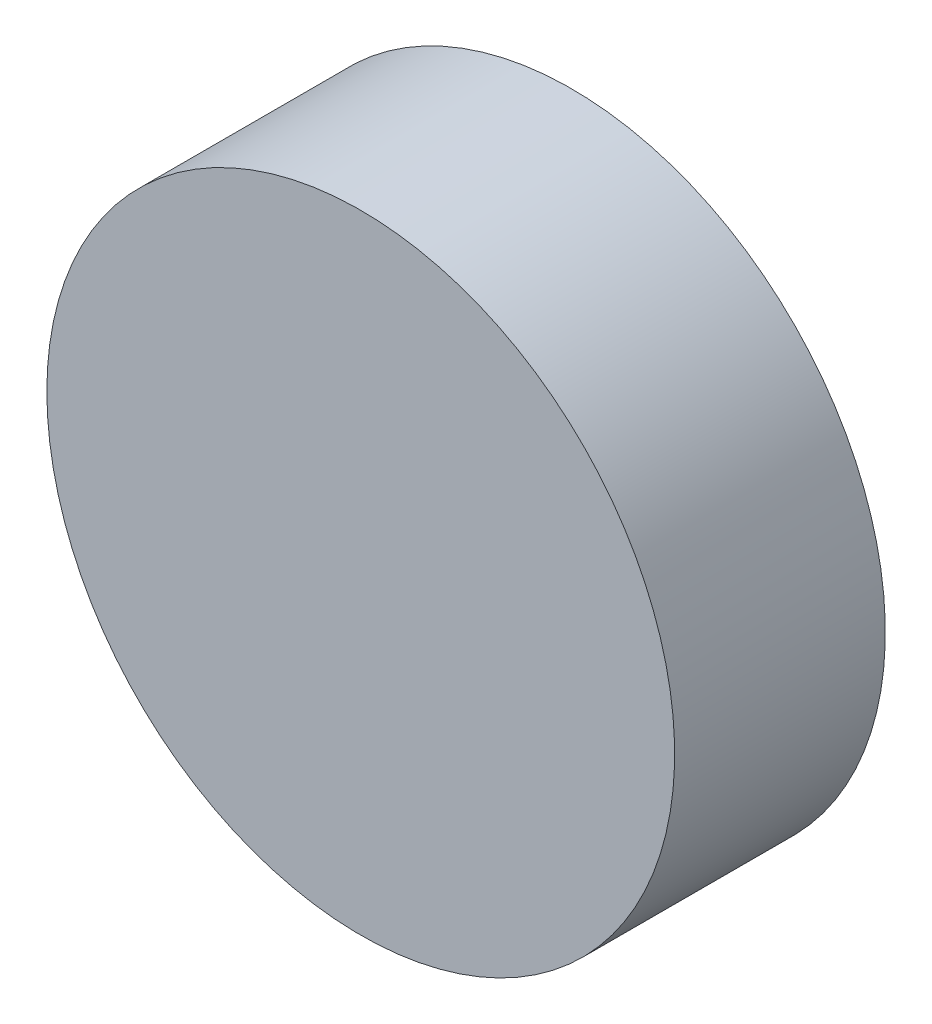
from build123d import *

# Parameters (mm, degrees)
SKETCH1_R           = 28.575
BOSS_EXTRUDE1_DEPTH = 19.177


with BuildPart() as part:
    # Sketch1 → Boss-Extrude1 (new body)
    with BuildSketch(Plane.XY):
        with Locations(Location((0, 0, 0), (0, 0, 180))):
            Circle(SKETCH1_R)
    extrude(amount=BOSS_EXTRUDE1_DEPTH)


solid = part.part
